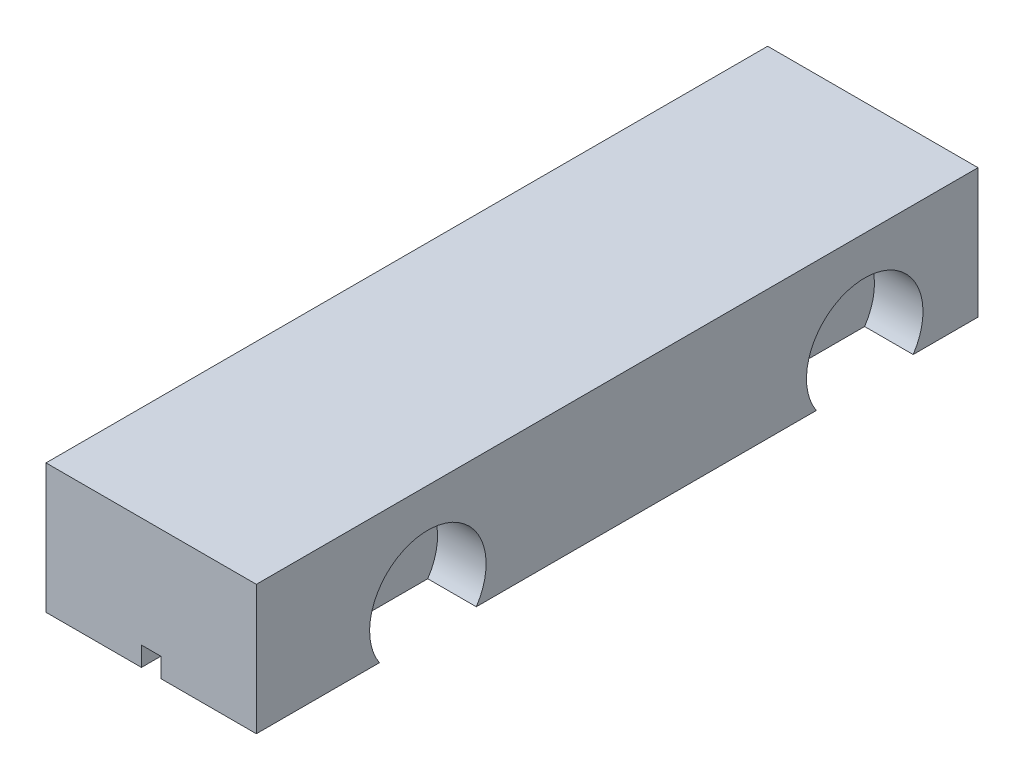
from build123d import *

# Parameters (mm, degrees)
SKETCH1_W               = 65
SKETCH1_H               = 40
BALSA_BLOCK_DEPTH       = 223
SKETCH2_W               = 6
SKETCH2_H               = 6
SCREW_EYE_SLOT_DEPTH    = 229.878242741
SKETCH4_R               = 1.525
AXLE_HOLE_CUT_OUT_DEPTH = 236.698960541
ESQUISSE1_R             = 18
ENL_V_MAT_EXTRU_1_DEPTH = 15
ENL_V_START             = -15
ESQUISSE2_R             = 18
ENL_V_MAT_EXTRU_2_DEPTH = 15


with BuildPart() as part:
    # Sketch1 → Balsa Block (new body)
    with BuildSketch(Plane.XY):
        with Locations((0, 20)):
            Rectangle(SKETCH1_W, SKETCH1_H)
    extrude(amount=BALSA_BLOCK_DEPTH)

    # Sketch2 → Screw Eye Slot (cut, through all)
    with BuildSketch(Plane.XY.offset(223)):
        with Locations((0, 3)):
            Rectangle(SKETCH2_W, SKETCH2_H)
    extrude(amount=-SCREW_EYE_SLOT_DEPTH, mode=Mode.SUBTRACT)

    # Sketch4 → Axle Hole Cut Out (cut, through all)
    with BuildSketch(Plane(origin=(32.5, 0, 0), x_dir=(0, 0, -1), z_dir=(1, 0, 0))):
        with Locations((-170, 10)):
            Circle(SKETCH4_R)
        with Locations((-35, 10)):
            Circle(SKETCH4_R)
    extrude(amount=-AXLE_HOLE_CUT_OUT_DEPTH, mode=Mode.SUBTRACT)

    # Esquisse1 → Enl_v. mat.-Extru.1 (cut)
    with BuildSketch(Plane(origin=(32.5, 0, 0), x_dir=(0, 0, -1), z_dir=(1, 0, 0))):
        with Locations((-170, 10)):
            Circle(ESQUISSE1_R)
        with Locations((-35, 10)):
            Circle(ESQUISSE1_R)
    extrude(amount=-ENL_V_MAT_EXTRU_1_DEPTH, mode=Mode.SUBTRACT)

    # Esquisse2 → Enl_v. mat.-Extru.2 (cut)
    with BuildSketch(Plane.ZY.offset(32.5).offset(ENL_V_START)):
        with Locations((35, 10)):
            Circle(ESQUISSE2_R)
        with Locations((170, 10)):
            Circle(ESQUISSE2_R)
    extrude(amount=ENL_V_MAT_EXTRU_2_DEPTH, mode=Mode.SUBTRACT)


solid = part.part
